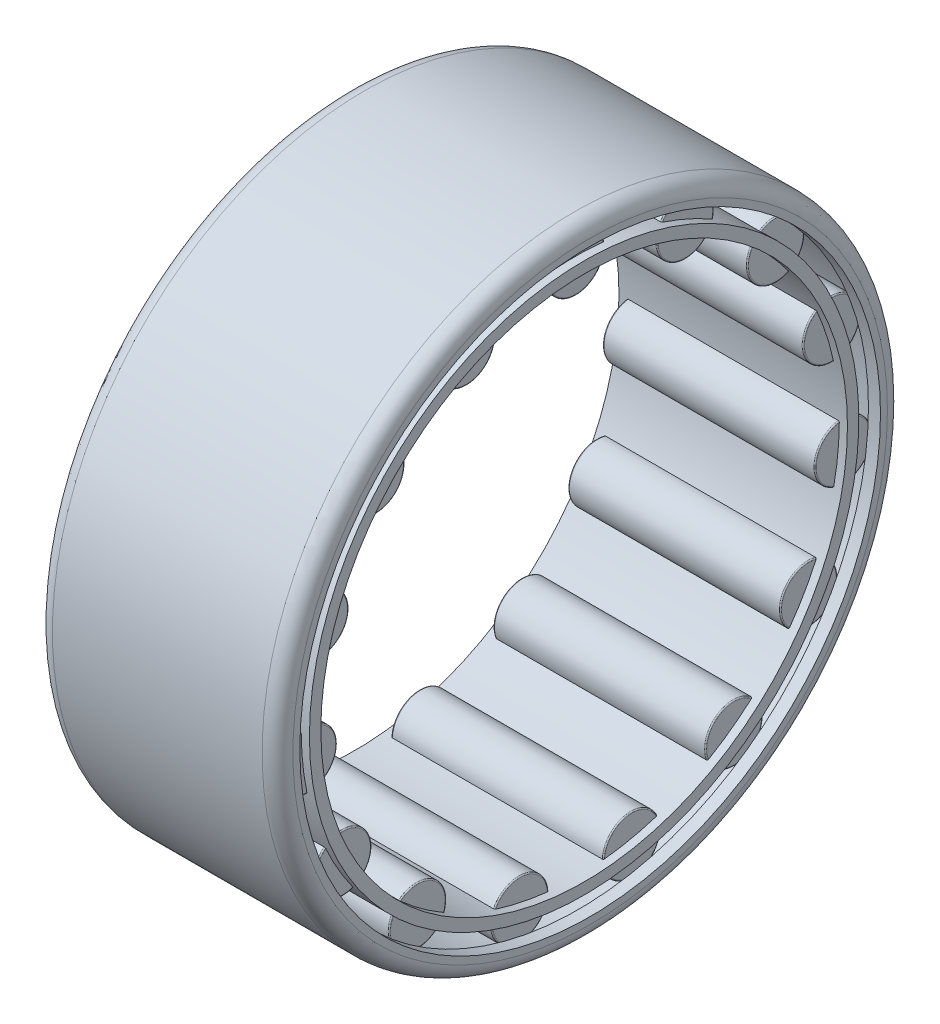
from build123d import *

# Parameters (mm, degrees)
CAGSPISKE_W           = 30.1625
CAGSPISKE_H           = 1.50642
ROLLERSDETAILED_COUNT = 15
ROLLERSDETAILED_ANGLE = 336


with BuildPart() as part:
    # InnRacSke → Race (revolve)
    with BuildSketch(Plane.XY, mode=Mode.PRIVATE) as race_sk:
        with BuildLine():
            Line((-14.2875, 38.3286), (-15.875, 38.3286))
            Line((-15.875, 38.3286), (-15.875, 39.243))
            ThreePointArc((-15.875, 39.243), (-15.279840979, 40.679840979), (-13.843, 41.275))
            Line((-13.843, 41.275), (13.843, 41.275))
            ThreePointArc((13.843, 41.275), (15.279840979, 40.679840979), (15.875, 39.243))
            Line((15.875, 39.243), (15.875, 38.3286))
            Line((15.875, 38.3286), (14.2875, 38.3286))
            Line((14.2875, 38.3286), (14.2875, 39.2811))
            Line((14.2875, 39.2811), (-14.2875, 39.2811))
            Line((-14.2875, 39.2811), (-14.2875, 38.3286))
        make_face()
    revolve(race_sk.sketch.rotate(Axis((-31.75, 0, 0), (1, 0, 0)), 270), axis=Axis((-31.75, 0, 0), (1, 0, 0)))

    # RolDetSke → RollerDetailed (revolve)
    with BuildSketch(Plane.XY, mode=Mode.PRIVATE) as rollerdetailed_sk:
        with BuildLine():
            Line((-14.00175, 39.130958), (-14.00175, 35.51555))
            Line((-14.00175, 35.51555), (14.00175, 35.51555))
            Line((14.00175, 35.51555), (14.00175, 39.130958))
            ThreePointArc((14.00175, 39.130958), (13.95762798, 39.23747798), (13.851108, 39.2816))
            Line((13.851108, 39.2816), (-13.851108, 39.2816))
            ThreePointArc((-13.851108, 39.2816), (-13.95762798, 39.23747798), (-14.00175, 39.130958))
        make_face()
    rollerdetailed = revolve(rollerdetailed_sk.sketch.rotate(Axis((-28.575, 35.51555, 0), (1, 0, 0)), 270), axis=Axis((-28.575, 35.51555, 0), (1, 0, 0)))

    # CagSpiSke → CageSpine (revolve)
    with BuildSketch(Plane.XY, mode=Mode.PRIVATE) as cagespine_sk:
        with Locations((0, 35.51555)):
            Rectangle(CAGSPISKE_W, CAGSPISKE_H)
    revolve(cagespine_sk.sketch.rotate(Axis((-31.75, 0, 0), (1, 0, 0)), 90), axis=Axis((-31.75, 0, 0), (1, 0, 0)))

    # RollersDetailed: RollerDetailed ×15 about axis
    rollersdetailed_axis = Axis((-50, 0, 0), (1, 0, 0))
    for i in range(1, ROLLERSDETAILED_COUNT):
        add(rollerdetailed.rotate(rollersdetailed_axis, i * ROLLERSDETAILED_ANGLE / (ROLLERSDETAILED_COUNT - 1)))


solid = part.part
